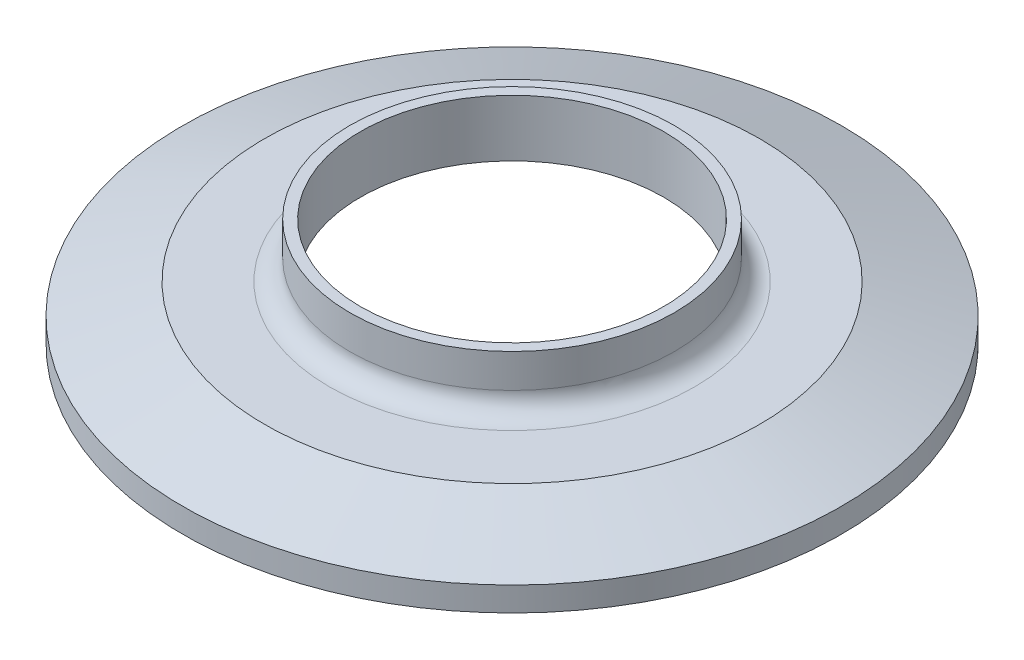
ISO-10303-21;
HEADER;
FILE_DESCRIPTION(('STEP AP214'),'2;1');
FILE_NAME('part.step','',(''),(''),'','','');
FILE_SCHEMA(('AUTOMOTIVE_DESIGN { 1 0 10303 214 1 1 1 1 }'));
ENDSEC;
DATA;
#1=APPLICATION_CONTEXT('core data for automotive mechanical design processes');
#2=APPLICATION_PROTOCOL_DEFINITION('international standard','automotive_design',2000,#1);
#3=PRODUCT_CONTEXT('',#1,'mechanical');
#4=PRODUCT('Part','Part','',(#3));
#5=PRODUCT_RELATED_PRODUCT_CATEGORY('part','',(#4));
#6=PRODUCT_DEFINITION_FORMATION('','',#4);
#7=PRODUCT_DEFINITION_CONTEXT('part definition',#1,'design');
#8=PRODUCT_DEFINITION('design','',#6,#7);
#9=PRODUCT_DEFINITION_SHAPE('','',#8);
#10=(LENGTH_UNIT() NAMED_UNIT(*) SI_UNIT(.MILLI.,.METRE.));
#11=(NAMED_UNIT(*) PLANE_ANGLE_UNIT() SI_UNIT($,.RADIAN.));
#12=(NAMED_UNIT(*) SI_UNIT($,.STERADIAN.) SOLID_ANGLE_UNIT());
#13=UNCERTAINTY_MEASURE_WITH_UNIT(LENGTH_MEASURE(1.E-05),#10,'distance_accuracy_value','');
#14=(GEOMETRIC_REPRESENTATION_CONTEXT(3) GLOBAL_UNCERTAINTY_ASSIGNED_CONTEXT((#13)) GLOBAL_UNIT_ASSIGNED_CONTEXT((#10,
#11,#12)) REPRESENTATION_CONTEXT('',''));
#15=CARTESIAN_POINT('',(0.,0.,0.));
#16=DIRECTION('',(0.,0.,1.));
#17=DIRECTION('',(1.,0.,0.));
#18=AXIS2_PLACEMENT_3D('',#15,#16,#17);
#19=CARTESIAN_POINT('',(-17.8054,12.7,0.));
#20=DIRECTION('',(0.,-1.,0.));
#21=DIRECTION('',(0.,0.,-1.));
#22=AXIS2_PLACEMENT_3D('',#19,#20,#21);
#23=PLANE('',#22);
#24=CARTESIAN_POINT('',(0.,12.7,0.));
#25=DIRECTION('',(0.,-1.,0.));
#26=DIRECTION('',(0.,0.,-1.));
#27=AXIS2_PLACEMENT_3D('',#24,#25,#26);
#28=CIRCLE('',#27,19.05);
#29=CARTESIAN_POINT('',(0.,12.7,-19.05));
#30=VERTEX_POINT('',#29);
#31=EDGE_CURVE('E12',#30,#30,#28,.T.);
#32=ORIENTED_EDGE('',*,*,#31,.F.);
#33=EDGE_LOOP('',(#32));
#34=FACE_BOUND('',#33,.T.);
#35=CARTESIAN_POINT('',(0.,12.7,0.));
#36=DIRECTION('',(0.,-1.,0.));
#37=DIRECTION('',(0.,0.,-1.));
#38=AXIS2_PLACEMENT_3D('',#35,#36,#37);
#39=CIRCLE('',#38,17.8054);
#40=CARTESIAN_POINT('',(0.,12.7,-17.8054));
#41=VERTEX_POINT('',#40);
#42=EDGE_CURVE('E88',#41,#41,#39,.T.);
#43=ORIENTED_EDGE('',*,*,#42,.T.);
#44=EDGE_LOOP('',(#43));
#45=FACE_BOUND('',#44,.T.);
#46=ADVANCED_FACE('F39',(#34,#45),#23,.F.);
#47=CARTESIAN_POINT('',(0.,0.,0.));
#48=DIRECTION('',(0.,-1.,0.));
#49=DIRECTION('',(0.,0.,-1.));
#50=AXIS2_PLACEMENT_3D('',#47,#48,#49);
#51=CYLINDRICAL_SURFACE('',#50,19.05);
#52=CARTESIAN_POINT('',(0.,8.73760000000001,0.));
#53=DIRECTION('',(0.,-1.,0.));
#54=DIRECTION('',(0.,0.,-1.));
#55=AXIS2_PLACEMENT_3D('',#52,#53,#54);
#56=CIRCLE('',#55,19.05);
#57=CARTESIAN_POINT('',(0.,8.73760000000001,-19.05));
#58=VERTEX_POINT('',#57);
#59=EDGE_CURVE('E45',#58,#58,#56,.T.);
#60=ORIENTED_EDGE('',*,*,#59,.F.);
#61=EDGE_LOOP('',(#60));
#62=FACE_BOUND('',#61,.T.);
#63=ORIENTED_EDGE('',*,*,#31,.T.);
#64=EDGE_LOOP('',(#63));
#65=FACE_BOUND('',#64,.T.);
#66=ADVANCED_FACE('F167',(#62,#65),#51,.T.);
#67=CARTESIAN_POINT('',(0.,8.73760000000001,0.));
#68=DIRECTION('',(0.,-1.,0.));
#69=DIRECTION('',(0.,0.,-1.));
#70=AXIS2_PLACEMENT_3D('',#67,#68,#69);
#71=TOROIDAL_SURFACE('',#70,21.4376,2.3876);
#72=CARTESIAN_POINT('',(0.,6.34999999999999,0.));
#73=DIRECTION('',(0.,-1.,0.));
#74=DIRECTION('',(0.,0.,-1.));
#75=AXIS2_PLACEMENT_3D('',#72,#73,#74);
#76=CIRCLE('',#75,21.4376);
#77=CARTESIAN_POINT('',(0.,6.34999999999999,-21.4376));
#78=VERTEX_POINT('',#77);
#79=EDGE_CURVE('E49',#78,#78,#76,.T.);
#80=ORIENTED_EDGE('',*,*,#79,.F.);
#81=EDGE_LOOP('',(#80));
#82=FACE_BOUND('',#81,.T.);
#83=ORIENTED_EDGE('',*,*,#59,.T.);
#84=EDGE_LOOP('',(#83));
#85=FACE_BOUND('',#84,.T.);
#86=ADVANCED_FACE('F162',(#82,#85),#71,.F.);
#87=CARTESIAN_POINT('',(-21.4376,6.34999999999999,0.));
#88=DIRECTION('',(0.,-1.,0.));
#89=DIRECTION('',(0.,0.,-1.));
#90=AXIS2_PLACEMENT_3D('',#87,#88,#89);
#91=PLANE('',#90);
#92=CARTESIAN_POINT('',(0.,6.34999999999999,0.));
#93=DIRECTION('',(0.,-1.,0.));
#94=DIRECTION('',(0.,0.,-1.));
#95=AXIS2_PLACEMENT_3D('',#92,#93,#94);
#96=CIRCLE('',#95,29.0664421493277);
#97=CARTESIAN_POINT('',(0.,6.34999999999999,-29.0664421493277));
#98=VERTEX_POINT('',#97);
#99=EDGE_CURVE('E53',#98,#98,#96,.T.);
#100=ORIENTED_EDGE('',*,*,#99,.F.);
#101=EDGE_LOOP('',(#100));
#102=FACE_BOUND('',#101,.T.);
#103=ORIENTED_EDGE('',*,*,#79,.T.);
#104=EDGE_LOOP('',(#103));
#105=FACE_BOUND('',#104,.T.);
#106=ADVANCED_FACE('F156',(#102,#105),#91,.F.);
#107=CARTESIAN_POINT('',(0.,6.34999999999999,0.));
#108=DIRECTION('',(0.,-1.,0.));
#109=DIRECTION('',(0.,0.,-1.));
#110=AXIS2_PLACEMENT_3D('',#107,#108,#109);
#111=CONICAL_SURFACE('',#110,29.0664421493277,1.22173047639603);
#112=CARTESIAN_POINT('',(0.,2.84480000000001,0.));
#113=DIRECTION('',(0.,-1.,0.));
#114=DIRECTION('',(0.,0.,-1.));
#115=AXIS2_PLACEMENT_3D('',#112,#113,#114);
#116=CIRCLE('',#115,38.6969);
#117=CARTESIAN_POINT('',(0.,2.84480000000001,-38.6969));
#118=VERTEX_POINT('',#117);
#119=EDGE_CURVE('E58',#118,#118,#116,.T.);
#120=ORIENTED_EDGE('',*,*,#119,.F.);
#121=EDGE_LOOP('',(#120));
#122=FACE_BOUND('',#121,.T.);
#123=ORIENTED_EDGE('',*,*,#99,.T.);
#124=EDGE_LOOP('',(#123));
#125=FACE_BOUND('',#124,.T.);
#126=ADVANCED_FACE('F150',(#122,#125),#111,.T.);
#127=CARTESIAN_POINT('',(0.,0.,0.));
#128=DIRECTION('',(0.,-1.,0.));
#129=DIRECTION('',(0.,0.,-1.));
#130=AXIS2_PLACEMENT_3D('',#127,#128,#129);
#131=CYLINDRICAL_SURFACE('',#130,38.6969);
#132=CARTESIAN_POINT('',(0.,0.,0.));
#133=DIRECTION('',(0.,-1.,0.));
#134=DIRECTION('',(0.,0.,-1.));
#135=AXIS2_PLACEMENT_3D('',#132,#133,#134);
#136=CIRCLE('',#135,38.6969);
#137=CARTESIAN_POINT('',(0.,0.,-38.6969));
#138=VERTEX_POINT('',#137);
#139=EDGE_CURVE('E61',#138,#138,#136,.T.);
#140=ORIENTED_EDGE('',*,*,#139,.F.);
#141=EDGE_LOOP('',(#140));
#142=FACE_BOUND('',#141,.T.);
#143=ORIENTED_EDGE('',*,*,#119,.T.);
#144=EDGE_LOOP('',(#143));
#145=FACE_BOUND('',#144,.T.);
#146=ADVANCED_FACE('F144',(#142,#145),#131,.T.);
#147=CARTESIAN_POINT('',(0.,0.,0.));
#148=DIRECTION('',(0.,-1.,0.));
#149=DIRECTION('',(0.,0.,-1.));
#150=AXIS2_PLACEMENT_3D('',#147,#148,#149);
#151=CONICAL_SURFACE('',#150,38.6969,1.56939586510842);
#152=CARTESIAN_POINT('',(0.,0.00251246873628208,0.));
#153=DIRECTION('',(0.,-1.,0.));
#154=DIRECTION('',(0.,0.,-1.));
#155=AXIS2_PLACEMENT_3D('',#152,#153,#154);
#156=CIRCLE('',#155,36.9028722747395);
#157=CARTESIAN_POINT('',(0.,0.00251246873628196,-36.9028722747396));
#158=VERTEX_POINT('',#157);
#159=EDGE_CURVE('E64',#158,#158,#156,.T.);
#160=ORIENTED_EDGE('',*,*,#159,.F.);
#161=EDGE_LOOP('',(#160));
#162=FACE_BOUND('',#161,.T.);
#163=ORIENTED_EDGE('',*,*,#139,.T.);
#164=EDGE_LOOP('',(#163));
#165=FACE_BOUND('',#164,.T.);
#166=ADVANCED_FACE('F138',(#162,#165),#151,.F.);
#167=CARTESIAN_POINT('',(0.,0.789912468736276,0.));
#168=DIRECTION('',(0.,-1.,0.));
#169=DIRECTION('',(0.,0.,-1.));
#170=AXIS2_PLACEMENT_3D('',#167,#168,#169);
#171=TOROIDAL_SURFACE('',#170,36.9028722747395,0.787400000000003);
#172=CARTESIAN_POINT('',(0.,0.482250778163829,0.));
#173=DIRECTION('',(0.,-1.,0.));
#174=DIRECTION('',(0.,0.,-1.));
#175=AXIS2_PLACEMENT_3D('',#172,#173,#174);
#176=CIRCLE('',#175,36.178066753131);
#177=CARTESIAN_POINT('',(0.,0.482250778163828,-36.1780667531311));
#178=VERTEX_POINT('',#177);
#179=EDGE_CURVE('E67',#178,#178,#176,.T.);
#180=ORIENTED_EDGE('',*,*,#179,.F.);
#181=EDGE_LOOP('',(#180));
#182=FACE_BOUND('',#181,.T.);
#183=ORIENTED_EDGE('',*,*,#159,.T.);
#184=EDGE_LOOP('',(#183));
#185=FACE_BOUND('',#184,.T.);
#186=ADVANCED_FACE('F132',(#182,#185),#171,.T.);
#187=CARTESIAN_POINT('',(0.,0.482250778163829,0.));
#188=DIRECTION('',(0.,-1.,0.));
#189=DIRECTION('',(0.,0.,-1.));
#190=AXIS2_PLACEMENT_3D('',#187,#188,#189);
#191=CONICAL_SURFACE('',#190,36.178066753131,0.401425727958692);
#192=CARTESIAN_POINT('',(0.,0.729197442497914,0.));
#193=DIRECTION('',(0.,-1.,0.));
#194=DIRECTION('',(0.,0.,-1.));
#195=AXIS2_PLACEMENT_3D('',#192,#193,#194);
#196=CIRCLE('',#195,36.0732441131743);
#197=CARTESIAN_POINT('',(0.,0.729197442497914,-36.0732441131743));
#198=VERTEX_POINT('',#197);
#199=EDGE_CURVE('E70',#198,#198,#196,.T.);
#200=ORIENTED_EDGE('',*,*,#199,.F.);
#201=EDGE_LOOP('',(#200));
#202=FACE_BOUND('',#201,.T.);
#203=ORIENTED_EDGE('',*,*,#179,.T.);
#204=EDGE_LOOP('',(#203));
#205=FACE_BOUND('',#204,.T.);
#206=ADVANCED_FACE('F126',(#202,#205),#191,.F.);
#207=CARTESIAN_POINT('',(0.,0.408912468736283,0.));
#208=DIRECTION('',(0.,-1.,0.));
#209=DIRECTION('',(0.,0.,-1.));
#210=AXIS2_PLACEMENT_3D('',#207,#208,#209);
#211=TOROIDAL_SURFACE('',#210,35.3187,0.81970682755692);
#212=CARTESIAN_POINT('',(0.,0.729197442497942,0.));
#213=DIRECTION('',(0.,-1.,0.));
#214=DIRECTION('',(0.,0.,-1.));
#215=AXIS2_PLACEMENT_3D('',#212,#213,#214);
#216=CIRCLE('',#215,34.5641558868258);
#217=CARTESIAN_POINT('',(0.,0.729197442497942,-34.5641558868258));
#218=VERTEX_POINT('',#217);
#219=EDGE_CURVE('E73',#218,#218,#216,.T.);
#220=ORIENTED_EDGE('',*,*,#219,.F.);
#221=EDGE_LOOP('',(#220));
#222=FACE_BOUND('',#221,.T.);
#223=ORIENTED_EDGE('',*,*,#199,.T.);
#224=EDGE_LOOP('',(#223));
#225=FACE_BOUND('',#224,.T.);
#226=ADVANCED_FACE('F120',(#222,#225),#211,.F.);
#227=CARTESIAN_POINT('',(0.,0.729197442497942,0.));
#228=DIRECTION('',(0.,1.,0.));
#229=DIRECTION('',(0.,0.,1.));
#230=AXIS2_PLACEMENT_3D('',#227,#228,#229);
#231=CONICAL_SURFACE('',#230,34.5641558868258,0.401425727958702);
#232=CARTESIAN_POINT('',(0.,0.336080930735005,0.));
#233=DIRECTION('',(0.,-1.,0.));
#234=DIRECTION('',(0.,0.,-1.));
#235=AXIS2_PLACEMENT_3D('',#232,#233,#234);
#236=CIRCLE('',#235,34.3972878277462);
#237=CARTESIAN_POINT('',(0.,0.336080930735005,-34.3972878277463));
#238=VERTEX_POINT('',#237);
#239=EDGE_CURVE('E76',#238,#238,#236,.T.);
#240=ORIENTED_EDGE('',*,*,#239,.F.);
#241=EDGE_LOOP('',(#240));
#242=FACE_BOUND('',#241,.T.);
#243=ORIENTED_EDGE('',*,*,#219,.T.);
#244=EDGE_LOOP('',(#243));
#245=FACE_BOUND('',#244,.T.);
#246=ADVANCED_FACE('F114',(#242,#245),#231,.T.);
#247=CARTESIAN_POINT('',(0.,0.643742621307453,0.));
#248=DIRECTION('',(0.,-1.,0.));
#249=DIRECTION('',(0.,0.,-1.));
#250=AXIS2_PLACEMENT_3D('',#247,#248,#249);
#251=TOROIDAL_SURFACE('',#250,33.6724823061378,0.7874);
#252=CARTESIAN_POINT('',(0.,-0.143657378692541,0.));
#253=DIRECTION('',(0.,-1.,0.));
#254=DIRECTION('',(0.,0.,-1.));
#255=AXIS2_PLACEMENT_3D('',#252,#253,#254);
#256=CIRCLE('',#255,33.6724823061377);
#257=CARTESIAN_POINT('',(0.,-0.143657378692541,-33.6724823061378));
#258=VERTEX_POINT('',#257);
#259=EDGE_CURVE('E79',#258,#258,#256,.T.);
#260=ORIENTED_EDGE('',*,*,#259,.F.);
#261=EDGE_LOOP('',(#260));
#262=FACE_BOUND('',#261,.T.);
#263=ORIENTED_EDGE('',*,*,#239,.T.);
#264=EDGE_LOOP('',(#263));
#265=FACE_BOUND('',#264,.T.);
#266=ADVANCED_FACE('F108',(#262,#265),#251,.T.);
#267=CARTESIAN_POINT('',(0.,-0.143657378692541,0.));
#268=DIRECTION('',(0.,-1.,0.));
#269=DIRECTION('',(0.,0.,-1.));
#270=AXIS2_PLACEMENT_3D('',#267,#268,#269);
#271=CONICAL_SURFACE('',#270,33.6724823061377,1.53061701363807);
#272=CARTESIAN_POINT('',(0.,0.,0.));
#273=DIRECTION('',(0.,-1.,0.));
#274=DIRECTION('',(0.,0.,-1.));
#275=AXIS2_PLACEMENT_3D('',#272,#273,#274);
#276=CIRCLE('',#275,30.099);
#277=CARTESIAN_POINT('',(0.,0.,-30.099));
#278=VERTEX_POINT('',#277);
#279=EDGE_CURVE('E82',#278,#278,#276,.T.);
#280=ORIENTED_EDGE('',*,*,#279,.F.);
#281=EDGE_LOOP('',(#280));
#282=FACE_BOUND('',#281,.T.);
#283=ORIENTED_EDGE('',*,*,#259,.T.);
#284=EDGE_LOOP('',(#283));
#285=FACE_BOUND('',#284,.T.);
#286=ADVANCED_FACE('F102',(#282,#285),#271,.F.);
#287=CARTESIAN_POINT('',(0.,0.,0.));
#288=DIRECTION('',(0.,-1.,0.));
#289=DIRECTION('',(0.,0.,-1.));
#290=AXIS2_PLACEMENT_3D('',#287,#288,#289);
#291=CONICAL_SURFACE('',#290,30.099,1.11526539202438);
#292=CARTESIAN_POINT('',(0.,6.02257249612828,0.));
#293=DIRECTION('',(0.,-1.,0.));
#294=DIRECTION('',(0.,0.,-1.));
#295=AXIS2_PLACEMENT_3D('',#292,#293,#294);
#296=CIRCLE('',#295,17.8054);
#297=CARTESIAN_POINT('',(0.,6.02257249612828,-17.8054));
#298=VERTEX_POINT('',#297);
#299=EDGE_CURVE('E85',#298,#298,#296,.T.);
#300=ORIENTED_EDGE('',*,*,#299,.F.);
#301=EDGE_LOOP('',(#300));
#302=FACE_BOUND('',#301,.T.);
#303=ORIENTED_EDGE('',*,*,#279,.T.);
#304=EDGE_LOOP('',(#303));
#305=FACE_BOUND('',#304,.T.);
#306=ADVANCED_FACE('F96',(#302,#305),#291,.F.);
#307=CARTESIAN_POINT('',(0.,0.,0.));
#308=DIRECTION('',(0.,-1.,0.));
#309=DIRECTION('',(0.,0.,-1.));
#310=AXIS2_PLACEMENT_3D('',#307,#308,#309);
#311=CYLINDRICAL_SURFACE('',#310,17.8054);
#312=ORIENTED_EDGE('',*,*,#42,.F.);
#313=EDGE_LOOP('',(#312));
#314=FACE_BOUND('',#313,.T.);
#315=ORIENTED_EDGE('',*,*,#299,.T.);
#316=EDGE_LOOP('',(#315));
#317=FACE_BOUND('',#316,.T.);
#318=ADVANCED_FACE('F93',(#314,#317),#311,.F.);
#319=CLOSED_SHELL('',(#46,#66,#86,#106,#126,#146,#166,#186,#206,#226,#246,#266,#286,#306,#318));
#320=MANIFOLD_SOLID_BREP('B2',#319);
#321=ADVANCED_BREP_SHAPE_REPRESENTATION('',(#18,#320),#14);
#322=SHAPE_DEFINITION_REPRESENTATION(#9,#321);
ENDSEC;
END-ISO-10303-21;
